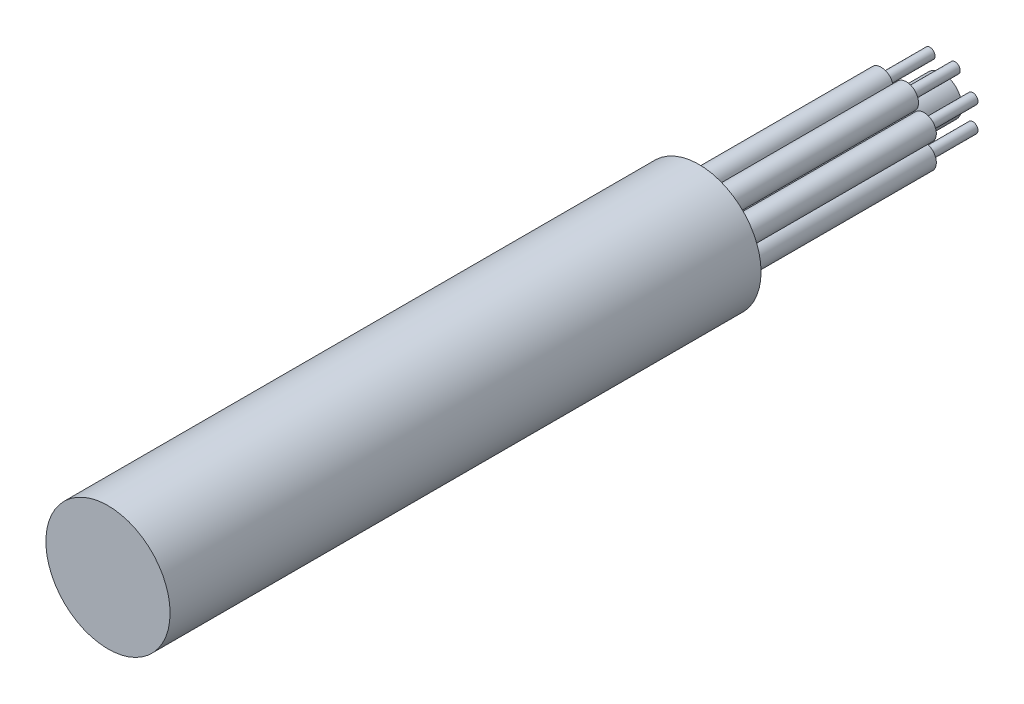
ISO-10303-21;
HEADER;
FILE_DESCRIPTION(('STEP AP214'),'2;1');
FILE_NAME('part.step','',(''),(''),'','','');
FILE_SCHEMA(('AUTOMOTIVE_DESIGN { 1 0 10303 214 1 1 1 1 }'));
ENDSEC;
DATA;
#1=APPLICATION_CONTEXT('core data for automotive mechanical design processes');
#2=APPLICATION_PROTOCOL_DEFINITION('international standard','automotive_design',2000,#1);
#3=PRODUCT_CONTEXT('',#1,'mechanical');
#4=PRODUCT('Part','Part','',(#3));
#5=PRODUCT_RELATED_PRODUCT_CATEGORY('part','',(#4));
#6=PRODUCT_DEFINITION_FORMATION('','',#4);
#7=PRODUCT_DEFINITION_CONTEXT('part definition',#1,'design');
#8=PRODUCT_DEFINITION('design','',#6,#7);
#9=PRODUCT_DEFINITION_SHAPE('','',#8);
#10=(LENGTH_UNIT() NAMED_UNIT(*) SI_UNIT(.MILLI.,.METRE.));
#11=(NAMED_UNIT(*) PLANE_ANGLE_UNIT() SI_UNIT($,.RADIAN.));
#12=(NAMED_UNIT(*) SI_UNIT($,.STERADIAN.) SOLID_ANGLE_UNIT());
#13=UNCERTAINTY_MEASURE_WITH_UNIT(LENGTH_MEASURE(1.E-05),#10,'distance_accuracy_value','');
#14=(GEOMETRIC_REPRESENTATION_CONTEXT(3) GLOBAL_UNCERTAINTY_ASSIGNED_CONTEXT((#13)) GLOBAL_UNIT_ASSIGNED_CONTEXT((#10,
#11,#12)) REPRESENTATION_CONTEXT('',''));
#15=CARTESIAN_POINT('',(0.,0.,0.));
#16=DIRECTION('',(0.,0.,1.));
#17=DIRECTION('',(1.,0.,0.));
#18=AXIS2_PLACEMENT_3D('',#15,#16,#17);
#19=CARTESIAN_POINT('',(0.,0.,-150.));
#20=DIRECTION('',(0.,0.,1.));
#21=DIRECTION('',(1.,0.,0.));
#22=AXIS2_PLACEMENT_3D('',#19,#20,#21);
#23=PLANE('',#22);
#24=CARTESIAN_POINT('',(-17.9775743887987,2.07026641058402E-08,-150.));
#25=DIRECTION('',(0.,0.,1.));
#26=DIRECTION('',(1.,0.,0.));
#27=AXIS2_PLACEMENT_3D('',#24,#25,#26);
#28=CIRCLE('',#27,2.55);
#29=CARTESIAN_POINT('',(-15.4275743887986,2.07026641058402E-08,-150.));
#30=VERTEX_POINT('',#29);
#31=EDGE_CURVE('E19',#30,#30,#28,.F.);
#32=ORIENTED_EDGE('',*,*,#31,.F.);
#33=EDGE_LOOP('',(#32));
#34=FACE_BOUND('',#33,.T.);
#35=ADVANCED_FACE('F15',(#34),#23,.T.);
#36=CARTESIAN_POINT('',(-18.2085442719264,-1.48067083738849,-184.265855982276));
#37=DIRECTION('',(0.,0.,-1.));
#38=DIRECTION('',(1.,0.,0.));
#39=AXIS2_PLACEMENT_3D('',#36,#37,#38);
#40=PLANE('',#39);
#41=CARTESIAN_POINT('',(-16.7303370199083,0.516622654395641,-184.265855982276));
#42=DIRECTION('',(0.,0.,-1.));
#43=DIRECTION('',(1.,0.,0.));
#44=AXIS2_PLACEMENT_3D('',#41,#42,#43);
#45=CIRCLE('',#44,0.2111005);
#46=CARTESIAN_POINT('',(-16.5192365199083,0.51662265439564,-184.265855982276));
#47=VERTEX_POINT('',#46);
#48=EDGE_CURVE('E10',#47,#47,#45,.F.);
#49=ORIENTED_EDGE('',*,*,#48,.F.);
#50=EDGE_LOOP('',(#49));
#51=FACE_BOUND('',#50,.T.);
#52=ADVANCED_FACE('F134',(#51),#40,.T.);
#53=CARTESIAN_POINT('',(-17.7466045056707,-1.28932912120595,-184.265855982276));
#54=DIRECTION('',(0.,0.,-1.));
#55=DIRECTION('',(1.,0.,0.));
#56=AXIS2_PLACEMENT_3D('',#53,#54,#55);
#57=PLANE('',#56);
#58=CARTESIAN_POINT('',(-19.2248117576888,-0.516622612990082,-184.265855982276));
#59=DIRECTION('',(0.,0.,-1.));
#60=DIRECTION('',(1.,0.,0.));
#61=AXIS2_PLACEMENT_3D('',#58,#59,#60);
#62=CIRCLE('',#61,0.2111005);
#63=CARTESIAN_POINT('',(-19.0137112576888,-0.516622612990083,-184.265855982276));
#64=VERTEX_POINT('',#63);
#65=EDGE_CURVE('E23',#64,#64,#62,.F.);
#66=ORIENTED_EDGE('',*,*,#65,.F.);
#67=EDGE_LOOP('',(#66));
#68=FACE_BOUND('',#67,.T.);
#69=ADVANCED_FACE('F140',(#68),#57,.T.);
#70=CARTESIAN_POINT('',(-17.7466045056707,-1.4806708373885,-184.265855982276));
#71=DIRECTION('',(0.,0.,-1.));
#72=DIRECTION('',(1.,0.,0.));
#73=AXIS2_PLACEMENT_3D('',#70,#71,#72);
#74=PLANE('',#73);
#75=CARTESIAN_POINT('',(-19.2248117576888,0.516622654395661,-184.265855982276));
#76=DIRECTION('',(0.,0.,-1.));
#77=DIRECTION('',(1.,0.,0.));
#78=AXIS2_PLACEMENT_3D('',#75,#76,#77);
#79=CIRCLE('',#78,0.2111005);
#80=CARTESIAN_POINT('',(-19.0137112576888,0.51662265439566,-184.265855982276));
#81=VERTEX_POINT('',#80);
#82=EDGE_CURVE('E28',#81,#81,#79,.F.);
#83=ORIENTED_EDGE('',*,*,#82,.F.);
#84=EDGE_LOOP('',(#83));
#85=FACE_BOUND('',#84,.T.);
#86=ADVANCED_FACE('F278',(#85),#74,.T.);
#87=CARTESIAN_POINT('',(-18.2085442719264,-1.28932912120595,-184.265855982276));
#88=DIRECTION('',(0.,0.,-1.));
#89=DIRECTION('',(1.,0.,0.));
#90=AXIS2_PLACEMENT_3D('',#87,#88,#89);
#91=PLANE('',#90);
#92=CARTESIAN_POINT('',(-16.7303370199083,-0.516622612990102,-184.265855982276));
#93=DIRECTION('',(0.,0.,-1.));
#94=DIRECTION('',(1.,0.,0.));
#95=AXIS2_PLACEMENT_3D('',#92,#93,#94);
#96=CIRCLE('',#95,0.2111005);
#97=CARTESIAN_POINT('',(-16.5192365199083,-0.516622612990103,-184.265855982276));
#98=VERTEX_POINT('',#97);
#99=EDGE_CURVE('E33',#98,#98,#96,.F.);
#100=ORIENTED_EDGE('',*,*,#99,.F.);
#101=EDGE_LOOP('',(#100));
#102=FACE_BOUND('',#101,.T.);
#103=ADVANCED_FACE('F274',(#102),#91,.T.);
#104=CARTESIAN_POINT('',(-18.0732452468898,-1.61596986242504,-184.265855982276));
#105=DIRECTION('',(0.,0.,-1.));
#106=DIRECTION('',(1.,0.,0.));
#107=AXIS2_PLACEMENT_3D('',#104,#105,#106);
#108=PLANE('',#107);
#109=CARTESIAN_POINT('',(-17.4609517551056,1.24723738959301,-184.265855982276));
#110=DIRECTION('',(0.,0.,-1.));
#111=DIRECTION('',(1.,0.,0.));
#112=AXIS2_PLACEMENT_3D('',#109,#110,#111);
#113=CIRCLE('',#112,0.2111005);
#114=CARTESIAN_POINT('',(-17.2498512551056,1.24723738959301,-184.265855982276));
#115=VERTEX_POINT('',#114);
#116=EDGE_CURVE('E36',#115,#115,#113,.F.);
#117=ORIENTED_EDGE('',*,*,#116,.F.);
#118=EDGE_LOOP('',(#117));
#119=FACE_BOUND('',#118,.T.);
#120=ADVANCED_FACE('F270',(#119),#108,.T.);
#121=CARTESIAN_POINT('',(-18.0732452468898,-1.1540300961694,-184.265855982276));
#122=DIRECTION('',(0.,0.,-1.));
#123=DIRECTION('',(1.,0.,0.));
#124=AXIS2_PLACEMENT_3D('',#121,#122,#123);
#125=PLANE('',#124);
#126=CARTESIAN_POINT('',(-17.4609517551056,-1.24723734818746,-184.265855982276));
#127=DIRECTION('',(0.,0.,-1.));
#128=DIRECTION('',(1.,0.,0.));
#129=AXIS2_PLACEMENT_3D('',#126,#127,#128);
#130=CIRCLE('',#129,0.2111005);
#131=CARTESIAN_POINT('',(-17.2498512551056,-1.24723734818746,-184.265855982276));
#132=VERTEX_POINT('',#131);
#133=EDGE_CURVE('E39',#132,#132,#130,.F.);
#134=ORIENTED_EDGE('',*,*,#133,.F.);
#135=EDGE_LOOP('',(#134));
#136=FACE_BOUND('',#135,.T.);
#137=ADVANCED_FACE('F266',(#136),#125,.T.);
#138=CARTESIAN_POINT('',(-17.8819035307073,-1.61596986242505,-184.265855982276));
#139=DIRECTION('',(0.,0.,-1.));
#140=DIRECTION('',(1.,0.,0.));
#141=AXIS2_PLACEMENT_3D('',#138,#139,#140);
#142=PLANE('',#141);
#143=CARTESIAN_POINT('',(-18.4941970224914,1.24723738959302,-184.265855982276));
#144=DIRECTION('',(0.,0.,-1.));
#145=DIRECTION('',(1.,0.,0.));
#146=AXIS2_PLACEMENT_3D('',#143,#144,#145);
#147=CIRCLE('',#146,0.2111005);
#148=CARTESIAN_POINT('',(-18.2830965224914,1.24723738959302,-184.265855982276));
#149=VERTEX_POINT('',#148);
#150=EDGE_CURVE('E42',#149,#149,#147,.F.);
#151=ORIENTED_EDGE('',*,*,#150,.F.);
#152=EDGE_LOOP('',(#151));
#153=FACE_BOUND('',#152,.T.);
#154=ADVANCED_FACE('F262',(#153),#142,.T.);
#155=CARTESIAN_POINT('',(-17.8819035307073,-1.1540300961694,-184.265855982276));
#156=DIRECTION('',(0.,0.,-1.));
#157=DIRECTION('',(1.,0.,0.));
#158=AXIS2_PLACEMENT_3D('',#155,#156,#157);
#159=PLANE('',#158);
#160=CARTESIAN_POINT('',(-18.4941970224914,-1.24723734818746,-184.265855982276));
#161=DIRECTION('',(0.,0.,-1.));
#162=DIRECTION('',(1.,0.,0.));
#163=AXIS2_PLACEMENT_3D('',#160,#161,#162);
#164=CIRCLE('',#163,0.2111005);
#165=CARTESIAN_POINT('',(-18.2830965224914,-1.24723734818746,-184.265855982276));
#166=VERTEX_POINT('',#165);
#167=EDGE_CURVE('E45',#166,#166,#164,.F.);
#168=ORIENTED_EDGE('',*,*,#167,.F.);
#169=EDGE_LOOP('',(#168));
#170=FACE_BOUND('',#169,.T.);
#171=ADVANCED_FACE('F259',(#170),#159,.T.);
#172=CARTESIAN_POINT('',(-16.7303370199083,0.516622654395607,-174.265855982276));
#173=DIRECTION('',(0.,0.,-1.));
#174=DIRECTION('',(1.,0.,0.));
#175=AXIS2_PLACEMENT_3D('',#172,#173,#174);
#176=CYLINDRICAL_SURFACE('',#175,0.2111005);
#177=ORIENTED_EDGE('',*,*,#48,.T.);
#178=EDGE_LOOP('',(#177));
#179=FACE_BOUND('',#178,.T.);
#180=CARTESIAN_POINT('',(-16.7303370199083,0.516622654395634,-182.265855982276));
#181=DIRECTION('',(0.,0.,-1.));
#182=DIRECTION('',(1.,0.,0.));
#183=AXIS2_PLACEMENT_3D('',#180,#181,#182);
#184=CIRCLE('',#183,0.2111005);
#185=CARTESIAN_POINT('',(-16.5192365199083,0.516622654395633,-182.265855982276));
#186=VERTEX_POINT('',#185);
#187=EDGE_CURVE('E48',#186,#186,#184,.F.);
#188=ORIENTED_EDGE('',*,*,#187,.F.);
#189=EDGE_LOOP('',(#188));
#190=FACE_BOUND('',#189,.T.);
#191=ADVANCED_FACE('F255',(#179,#190),#176,.T.);
#192=CARTESIAN_POINT('',(-19.2248117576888,-0.516622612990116,-174.265855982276));
#193=DIRECTION('',(0.,0.,-1.));
#194=DIRECTION('',(1.,0.,0.));
#195=AXIS2_PLACEMENT_3D('',#192,#193,#194);
#196=CYLINDRICAL_SURFACE('',#195,0.2111005);
#197=ORIENTED_EDGE('',*,*,#65,.T.);
#198=EDGE_LOOP('',(#197));
#199=FACE_BOUND('',#198,.T.);
#200=CARTESIAN_POINT('',(-19.2248117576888,-0.516622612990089,-182.265855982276));
#201=DIRECTION('',(0.,0.,-1.));
#202=DIRECTION('',(1.,0.,0.));
#203=AXIS2_PLACEMENT_3D('',#200,#201,#202);
#204=CIRCLE('',#203,0.2111005);
#205=CARTESIAN_POINT('',(-19.0137112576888,-0.51662261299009,-182.265855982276));
#206=VERTEX_POINT('',#205);
#207=EDGE_CURVE('E51',#206,#206,#204,.F.);
#208=ORIENTED_EDGE('',*,*,#207,.F.);
#209=EDGE_LOOP('',(#208));
#210=FACE_BOUND('',#209,.T.);
#211=ADVANCED_FACE('F251',(#199,#210),#196,.T.);
#212=CARTESIAN_POINT('',(-19.2248117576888,0.516622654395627,-174.265855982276));
#213=DIRECTION('',(0.,0.,-1.));
#214=DIRECTION('',(1.,0.,0.));
#215=AXIS2_PLACEMENT_3D('',#212,#213,#214);
#216=CYLINDRICAL_SURFACE('',#215,0.2111005);
#217=ORIENTED_EDGE('',*,*,#82,.T.);
#218=EDGE_LOOP('',(#217));
#219=FACE_BOUND('',#218,.T.);
#220=CARTESIAN_POINT('',(-19.2248117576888,0.516622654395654,-182.265855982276));
#221=DIRECTION('',(0.,0.,-1.));
#222=DIRECTION('',(1.,0.,0.));
#223=AXIS2_PLACEMENT_3D('',#220,#221,#222);
#224=CIRCLE('',#223,0.2111005);
#225=CARTESIAN_POINT('',(-19.0137112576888,0.516622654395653,-182.265855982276));
#226=VERTEX_POINT('',#225);
#227=EDGE_CURVE('E54',#226,#226,#224,.F.);
#228=ORIENTED_EDGE('',*,*,#227,.F.);
#229=EDGE_LOOP('',(#228));
#230=FACE_BOUND('',#229,.T.);
#231=ADVANCED_FACE('F247',(#219,#230),#216,.T.);
#232=CARTESIAN_POINT('',(-16.7303370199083,-0.516622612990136,-174.265855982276));
#233=DIRECTION('',(0.,0.,-1.));
#234=DIRECTION('',(1.,0.,0.));
#235=AXIS2_PLACEMENT_3D('',#232,#233,#234);
#236=CYLINDRICAL_SURFACE('',#235,0.2111005);
#237=ORIENTED_EDGE('',*,*,#99,.T.);
#238=EDGE_LOOP('',(#237));
#239=FACE_BOUND('',#238,.T.);
#240=CARTESIAN_POINT('',(-16.7303370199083,-0.516622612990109,-182.265855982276));
#241=DIRECTION('',(0.,0.,-1.));
#242=DIRECTION('',(1.,0.,0.));
#243=AXIS2_PLACEMENT_3D('',#240,#241,#242);
#244=CIRCLE('',#243,0.2111005);
#245=CARTESIAN_POINT('',(-16.5192365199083,-0.51662261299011,-182.265855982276));
#246=VERTEX_POINT('',#245);
#247=EDGE_CURVE('E57',#246,#246,#244,.F.);
#248=ORIENTED_EDGE('',*,*,#247,.F.);
#249=EDGE_LOOP('',(#248));
#250=FACE_BOUND('',#249,.T.);
#251=ADVANCED_FACE('F243',(#239,#250),#236,.T.);
#252=CARTESIAN_POINT('',(-17.4609517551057,1.24723738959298,-174.265855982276));
#253=DIRECTION('',(0.,0.,-1.));
#254=DIRECTION('',(1.,0.,0.));
#255=AXIS2_PLACEMENT_3D('',#252,#253,#254);
#256=CYLINDRICAL_SURFACE('',#255,0.2111005);
#257=ORIENTED_EDGE('',*,*,#116,.T.);
#258=EDGE_LOOP('',(#257));
#259=FACE_BOUND('',#258,.T.);
#260=CARTESIAN_POINT('',(-17.4609517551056,1.247237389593,-182.265855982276));
#261=DIRECTION('',(0.,0.,-1.));
#262=DIRECTION('',(1.,0.,0.));
#263=AXIS2_PLACEMENT_3D('',#260,#261,#262);
#264=CIRCLE('',#263,0.2111005);
#265=CARTESIAN_POINT('',(-17.2498512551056,1.247237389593,-182.265855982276));
#266=VERTEX_POINT('',#265);
#267=EDGE_CURVE('E60',#266,#266,#264,.F.);
#268=ORIENTED_EDGE('',*,*,#267,.F.);
#269=EDGE_LOOP('',(#268));
#270=FACE_BOUND('',#269,.T.);
#271=ADVANCED_FACE('F239',(#259,#270),#256,.T.);
#272=CARTESIAN_POINT('',(-17.4609517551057,-1.24723734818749,-174.265855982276));
#273=DIRECTION('',(0.,0.,-1.));
#274=DIRECTION('',(1.,0.,0.));
#275=AXIS2_PLACEMENT_3D('',#272,#273,#274);
#276=CYLINDRICAL_SURFACE('',#275,0.2111005);
#277=ORIENTED_EDGE('',*,*,#133,.T.);
#278=EDGE_LOOP('',(#277));
#279=FACE_BOUND('',#278,.T.);
#280=CARTESIAN_POINT('',(-17.4609517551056,-1.24723734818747,-182.265855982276));
#281=DIRECTION('',(0.,0.,-1.));
#282=DIRECTION('',(1.,0.,0.));
#283=AXIS2_PLACEMENT_3D('',#280,#281,#282);
#284=CIRCLE('',#283,0.2111005);
#285=CARTESIAN_POINT('',(-17.2498512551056,-1.24723734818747,-182.265855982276));
#286=VERTEX_POINT('',#285);
#287=EDGE_CURVE('E63',#286,#286,#284,.F.);
#288=ORIENTED_EDGE('',*,*,#287,.F.);
#289=EDGE_LOOP('',(#288));
#290=FACE_BOUND('',#289,.T.);
#291=ADVANCED_FACE('F235',(#279,#290),#276,.T.);
#292=CARTESIAN_POINT('',(-18.4941970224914,1.24723738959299,-174.265855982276));
#293=DIRECTION('',(0.,0.,-1.));
#294=DIRECTION('',(1.,0.,0.));
#295=AXIS2_PLACEMENT_3D('',#292,#293,#294);
#296=CYLINDRICAL_SURFACE('',#295,0.2111005);
#297=ORIENTED_EDGE('',*,*,#150,.T.);
#298=EDGE_LOOP('',(#297));
#299=FACE_BOUND('',#298,.T.);
#300=CARTESIAN_POINT('',(-18.4941970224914,1.24723738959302,-182.265855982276));
#301=DIRECTION('',(0.,0.,-1.));
#302=DIRECTION('',(1.,0.,0.));
#303=AXIS2_PLACEMENT_3D('',#300,#301,#302);
#304=CIRCLE('',#303,0.2111005);
#305=CARTESIAN_POINT('',(-18.2830965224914,1.24723738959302,-182.265855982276));
#306=VERTEX_POINT('',#305);
#307=EDGE_CURVE('E66',#306,#306,#304,.F.);
#308=ORIENTED_EDGE('',*,*,#307,.F.);
#309=EDGE_LOOP('',(#308));
#310=FACE_BOUND('',#309,.T.);
#311=ADVANCED_FACE('F231',(#299,#310),#296,.T.);
#312=CARTESIAN_POINT('',(-18.4941970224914,-1.24723734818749,-174.265855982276));
#313=DIRECTION('',(0.,0.,-1.));
#314=DIRECTION('',(1.,0.,0.));
#315=AXIS2_PLACEMENT_3D('',#312,#313,#314);
#316=CYLINDRICAL_SURFACE('',#315,0.2111005);
#317=ORIENTED_EDGE('',*,*,#167,.T.);
#318=EDGE_LOOP('',(#317));
#319=FACE_BOUND('',#318,.T.);
#320=CARTESIAN_POINT('',(-18.4941970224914,-1.24723734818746,-182.265855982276));
#321=DIRECTION('',(0.,0.,-1.));
#322=DIRECTION('',(1.,0.,0.));
#323=AXIS2_PLACEMENT_3D('',#320,#321,#322);
#324=CIRCLE('',#323,0.2111005);
#325=CARTESIAN_POINT('',(-18.2830965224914,-1.24723734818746,-182.265855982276));
#326=VERTEX_POINT('',#325);
#327=EDGE_CURVE('E69',#326,#326,#324,.F.);
#328=ORIENTED_EDGE('',*,*,#327,.F.);
#329=EDGE_LOOP('',(#328));
#330=FACE_BOUND('',#329,.T.);
#331=ADVANCED_FACE('F227',(#319,#330),#316,.T.);
#332=CARTESIAN_POINT('',(-18.2085442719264,-1.48067083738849,-182.265855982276));
#333=DIRECTION('',(0.,0.,-1.));
#334=DIRECTION('',(1.,0.,0.));
#335=AXIS2_PLACEMENT_3D('',#332,#333,#334);
#336=PLANE('',#335);
#337=CARTESIAN_POINT('',(-16.7303370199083,0.516622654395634,-182.265855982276));
#338=DIRECTION('',(0.,0.,-1.));
#339=DIRECTION('',(1.,0.,0.));
#340=AXIS2_PLACEMENT_3D('',#337,#338,#339);
#341=CIRCLE('',#340,0.5);
#342=CARTESIAN_POINT('',(-16.2303370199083,0.516622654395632,-182.265855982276));
#343=VERTEX_POINT('',#342);
#344=EDGE_CURVE('E72',#343,#343,#341,.F.);
#345=ORIENTED_EDGE('',*,*,#344,.F.);
#346=EDGE_LOOP('',(#345));
#347=FACE_BOUND('',#346,.T.);
#348=ORIENTED_EDGE('',*,*,#187,.T.);
#349=EDGE_LOOP('',(#348));
#350=FACE_BOUND('',#349,.T.);
#351=ADVANCED_FACE('F223',(#347,#350),#336,.T.);
#352=CARTESIAN_POINT('',(-17.7466045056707,-1.28932912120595,-182.265855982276));
#353=DIRECTION('',(0.,0.,-1.));
#354=DIRECTION('',(1.,0.,0.));
#355=AXIS2_PLACEMENT_3D('',#352,#353,#354);
#356=PLANE('',#355);
#357=CARTESIAN_POINT('',(-19.2248117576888,-0.516622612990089,-182.265855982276));
#358=DIRECTION('',(0.,0.,-1.));
#359=DIRECTION('',(1.,0.,0.));
#360=AXIS2_PLACEMENT_3D('',#357,#358,#359);
#361=CIRCLE('',#360,0.5);
#362=CARTESIAN_POINT('',(-18.7248117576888,-0.516622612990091,-182.265855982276));
#363=VERTEX_POINT('',#362);
#364=EDGE_CURVE('E75',#363,#363,#361,.F.);
#365=ORIENTED_EDGE('',*,*,#364,.F.);
#366=EDGE_LOOP('',(#365));
#367=FACE_BOUND('',#366,.T.);
#368=ORIENTED_EDGE('',*,*,#207,.T.);
#369=EDGE_LOOP('',(#368));
#370=FACE_BOUND('',#369,.T.);
#371=ADVANCED_FACE('F219',(#367,#370),#356,.T.);
#372=CARTESIAN_POINT('',(-17.7466045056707,-1.4806708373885,-182.265855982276));
#373=DIRECTION('',(0.,0.,-1.));
#374=DIRECTION('',(1.,0.,0.));
#375=AXIS2_PLACEMENT_3D('',#372,#373,#374);
#376=PLANE('',#375);
#377=CARTESIAN_POINT('',(-19.2248117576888,0.516622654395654,-182.265855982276));
#378=DIRECTION('',(0.,0.,-1.));
#379=DIRECTION('',(1.,0.,0.));
#380=AXIS2_PLACEMENT_3D('',#377,#378,#379);
#381=CIRCLE('',#380,0.5);
#382=CARTESIAN_POINT('',(-18.7248117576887,0.516622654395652,-182.265855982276));
#383=VERTEX_POINT('',#382);
#384=EDGE_CURVE('E78',#383,#383,#381,.F.);
#385=ORIENTED_EDGE('',*,*,#384,.F.);
#386=EDGE_LOOP('',(#385));
#387=FACE_BOUND('',#386,.T.);
#388=ORIENTED_EDGE('',*,*,#227,.T.);
#389=EDGE_LOOP('',(#388));
#390=FACE_BOUND('',#389,.T.);
#391=ADVANCED_FACE('F215',(#387,#390),#376,.T.);
#392=CARTESIAN_POINT('',(-18.2085442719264,-1.28932912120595,-182.265855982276));
#393=DIRECTION('',(0.,0.,-1.));
#394=DIRECTION('',(1.,0.,0.));
#395=AXIS2_PLACEMENT_3D('',#392,#393,#394);
#396=PLANE('',#395);
#397=CARTESIAN_POINT('',(-16.7303370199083,-0.516622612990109,-182.265855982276));
#398=DIRECTION('',(0.,0.,-1.));
#399=DIRECTION('',(1.,0.,0.));
#400=AXIS2_PLACEMENT_3D('',#397,#398,#399);
#401=CIRCLE('',#400,0.5);
#402=CARTESIAN_POINT('',(-16.2303370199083,-0.516622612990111,-182.265855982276));
#403=VERTEX_POINT('',#402);
#404=EDGE_CURVE('E81',#403,#403,#401,.F.);
#405=ORIENTED_EDGE('',*,*,#404,.F.);
#406=EDGE_LOOP('',(#405));
#407=FACE_BOUND('',#406,.T.);
#408=ORIENTED_EDGE('',*,*,#247,.T.);
#409=EDGE_LOOP('',(#408));
#410=FACE_BOUND('',#409,.T.);
#411=ADVANCED_FACE('F211',(#407,#410),#396,.T.);
#412=CARTESIAN_POINT('',(-18.0732452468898,-1.61596986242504,-182.265855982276));
#413=DIRECTION('',(0.,0.,-1.));
#414=DIRECTION('',(1.,0.,0.));
#415=AXIS2_PLACEMENT_3D('',#412,#413,#414);
#416=PLANE('',#415);
#417=CARTESIAN_POINT('',(-17.4609517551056,1.247237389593,-182.265855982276));
#418=DIRECTION('',(0.,0.,-1.));
#419=DIRECTION('',(1.,0.,0.));
#420=AXIS2_PLACEMENT_3D('',#417,#418,#419);
#421=CIRCLE('',#420,0.5);
#422=CARTESIAN_POINT('',(-16.9609517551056,1.247237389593,-182.265855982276));
#423=VERTEX_POINT('',#422);
#424=EDGE_CURVE('E84',#423,#423,#421,.F.);
#425=ORIENTED_EDGE('',*,*,#424,.F.);
#426=EDGE_LOOP('',(#425));
#427=FACE_BOUND('',#426,.T.);
#428=ORIENTED_EDGE('',*,*,#267,.T.);
#429=EDGE_LOOP('',(#428));
#430=FACE_BOUND('',#429,.T.);
#431=ADVANCED_FACE('F207',(#427,#430),#416,.T.);
#432=CARTESIAN_POINT('',(-18.0732452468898,-1.1540300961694,-182.265855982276));
#433=DIRECTION('',(0.,0.,-1.));
#434=DIRECTION('',(1.,0.,0.));
#435=AXIS2_PLACEMENT_3D('',#432,#433,#434);
#436=PLANE('',#435);
#437=CARTESIAN_POINT('',(-17.4609517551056,-1.24723734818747,-182.265855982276));
#438=DIRECTION('',(0.,0.,-1.));
#439=DIRECTION('',(1.,0.,0.));
#440=AXIS2_PLACEMENT_3D('',#437,#438,#439);
#441=CIRCLE('',#440,0.5);
#442=CARTESIAN_POINT('',(-16.9609517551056,-1.24723734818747,-182.265855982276));
#443=VERTEX_POINT('',#442);
#444=EDGE_CURVE('E87',#443,#443,#441,.F.);
#445=ORIENTED_EDGE('',*,*,#444,.F.);
#446=EDGE_LOOP('',(#445));
#447=FACE_BOUND('',#446,.T.);
#448=ORIENTED_EDGE('',*,*,#287,.T.);
#449=EDGE_LOOP('',(#448));
#450=FACE_BOUND('',#449,.T.);
#451=ADVANCED_FACE('F203',(#447,#450),#436,.T.);
#452=CARTESIAN_POINT('',(-17.8819035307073,-1.61596986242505,-182.265855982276));
#453=DIRECTION('',(0.,0.,-1.));
#454=DIRECTION('',(1.,0.,0.));
#455=AXIS2_PLACEMENT_3D('',#452,#453,#454);
#456=PLANE('',#455);
#457=CARTESIAN_POINT('',(-18.4941970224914,1.24723738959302,-182.265855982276));
#458=DIRECTION('',(0.,0.,-1.));
#459=DIRECTION('',(1.,0.,0.));
#460=AXIS2_PLACEMENT_3D('',#457,#458,#459);
#461=CIRCLE('',#460,0.5);
#462=CARTESIAN_POINT('',(-17.9941970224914,1.24723738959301,-182.265855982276));
#463=VERTEX_POINT('',#462);
#464=EDGE_CURVE('E90',#463,#463,#461,.F.);
#465=ORIENTED_EDGE('',*,*,#464,.F.);
#466=EDGE_LOOP('',(#465));
#467=FACE_BOUND('',#466,.T.);
#468=ORIENTED_EDGE('',*,*,#307,.T.);
#469=EDGE_LOOP('',(#468));
#470=FACE_BOUND('',#469,.T.);
#471=ADVANCED_FACE('F199',(#467,#470),#456,.T.);
#472=CARTESIAN_POINT('',(-17.8819035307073,-1.1540300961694,-182.265855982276));
#473=DIRECTION('',(0.,0.,-1.));
#474=DIRECTION('',(1.,0.,0.));
#475=AXIS2_PLACEMENT_3D('',#472,#473,#474);
#476=PLANE('',#475);
#477=CARTESIAN_POINT('',(-18.4941970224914,-1.24723734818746,-182.265855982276));
#478=DIRECTION('',(0.,0.,-1.));
#479=DIRECTION('',(1.,0.,0.));
#480=AXIS2_PLACEMENT_3D('',#477,#478,#479);
#481=CIRCLE('',#480,0.5);
#482=CARTESIAN_POINT('',(-17.9941970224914,-1.24723734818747,-182.265855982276));
#483=VERTEX_POINT('',#482);
#484=EDGE_CURVE('E93',#483,#483,#481,.F.);
#485=ORIENTED_EDGE('',*,*,#484,.F.);
#486=EDGE_LOOP('',(#485));
#487=FACE_BOUND('',#486,.T.);
#488=ORIENTED_EDGE('',*,*,#327,.T.);
#489=EDGE_LOOP('',(#488));
#490=FACE_BOUND('',#489,.T.);
#491=ADVANCED_FACE('F195',(#487,#490),#476,.T.);
#492=CARTESIAN_POINT('',(-17.9775743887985,-1.38499997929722,-184.265855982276));
#493=DIRECTION('',(0.,0.,-1.));
#494=DIRECTION('',(1.,0.,0.));
#495=AXIS2_PLACEMENT_3D('',#492,#493,#494);
#496=PLANE('',#495);
#497=CARTESIAN_POINT('',(-17.9775743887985,2.07027796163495E-08,-184.265855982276));
#498=DIRECTION('',(0.,0.,-1.));
#499=DIRECTION('',(1.,0.,0.));
#500=AXIS2_PLACEMENT_3D('',#497,#498,#499);
#501=CIRCLE('',#500,0.8);
#502=CARTESIAN_POINT('',(-17.1775743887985,2.07027768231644E-08,-184.265855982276));
#503=VERTEX_POINT('',#502);
#504=EDGE_CURVE('E96',#503,#503,#501,.F.);
#505=ORIENTED_EDGE('',*,*,#504,.F.);
#506=EDGE_LOOP('',(#505));
#507=FACE_BOUND('',#506,.T.);
#508=ADVANCED_FACE('F191',(#507),#496,.T.);
#509=CARTESIAN_POINT('',(-16.7303370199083,0.516622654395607,-174.265855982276));
#510=DIRECTION('',(0.,0.,-1.));
#511=DIRECTION('',(1.,0.,0.));
#512=AXIS2_PLACEMENT_3D('',#509,#510,#511);
#513=CYLINDRICAL_SURFACE('',#512,0.5);
#514=ORIENTED_EDGE('',*,*,#344,.T.);
#515=EDGE_LOOP('',(#514));
#516=FACE_BOUND('',#515,.T.);
#517=CARTESIAN_POINT('',(-16.7303370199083,0.516622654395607,-174.265855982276));
#518=DIRECTION('',(0.,0.,-1.));
#519=DIRECTION('',(1.,0.,0.));
#520=AXIS2_PLACEMENT_3D('',#517,#518,#519);
#521=CIRCLE('',#520,0.5);
#522=CARTESIAN_POINT('',(-16.2303370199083,0.516622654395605,-174.265855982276));
#523=VERTEX_POINT('',#522);
#524=EDGE_CURVE('E99',#523,#523,#521,.F.);
#525=ORIENTED_EDGE('',*,*,#524,.F.);
#526=EDGE_LOOP('',(#525));
#527=FACE_BOUND('',#526,.T.);
#528=ADVANCED_FACE('F187',(#516,#527),#513,.T.);
#529=CARTESIAN_POINT('',(-19.2248117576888,-0.516622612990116,-174.265855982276));
#530=DIRECTION('',(0.,0.,-1.));
#531=DIRECTION('',(1.,0.,0.));
#532=AXIS2_PLACEMENT_3D('',#529,#530,#531);
#533=CYLINDRICAL_SURFACE('',#532,0.5);
#534=ORIENTED_EDGE('',*,*,#364,.T.);
#535=EDGE_LOOP('',(#534));
#536=FACE_BOUND('',#535,.T.);
#537=CARTESIAN_POINT('',(-19.2248117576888,-0.516622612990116,-174.265855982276));
#538=DIRECTION('',(0.,0.,-1.));
#539=DIRECTION('',(1.,0.,0.));
#540=AXIS2_PLACEMENT_3D('',#537,#538,#539);
#541=CIRCLE('',#540,0.5);
#542=CARTESIAN_POINT('',(-18.7248117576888,-0.516622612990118,-174.265855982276));
#543=VERTEX_POINT('',#542);
#544=EDGE_CURVE('E102',#543,#543,#541,.F.);
#545=ORIENTED_EDGE('',*,*,#544,.F.);
#546=EDGE_LOOP('',(#545));
#547=FACE_BOUND('',#546,.T.);
#548=ADVANCED_FACE('F183',(#536,#547),#533,.T.);
#549=CARTESIAN_POINT('',(-19.2248117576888,0.516622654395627,-174.265855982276));
#550=DIRECTION('',(0.,0.,-1.));
#551=DIRECTION('',(1.,0.,0.));
#552=AXIS2_PLACEMENT_3D('',#549,#550,#551);
#553=CYLINDRICAL_SURFACE('',#552,0.5);
#554=ORIENTED_EDGE('',*,*,#384,.T.);
#555=EDGE_LOOP('',(#554));
#556=FACE_BOUND('',#555,.T.);
#557=CARTESIAN_POINT('',(-19.2248117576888,0.516622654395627,-174.265855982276));
#558=DIRECTION('',(0.,0.,-1.));
#559=DIRECTION('',(1.,0.,0.));
#560=AXIS2_PLACEMENT_3D('',#557,#558,#559);
#561=CIRCLE('',#560,0.5);
#562=CARTESIAN_POINT('',(-18.7248117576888,0.516622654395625,-174.265855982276));
#563=VERTEX_POINT('',#562);
#564=EDGE_CURVE('E105',#563,#563,#561,.F.);
#565=ORIENTED_EDGE('',*,*,#564,.F.);
#566=EDGE_LOOP('',(#565));
#567=FACE_BOUND('',#566,.T.);
#568=ADVANCED_FACE('F179',(#556,#567),#553,.T.);
#569=CARTESIAN_POINT('',(-16.7303370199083,-0.516622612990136,-174.265855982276));
#570=DIRECTION('',(0.,0.,-1.));
#571=DIRECTION('',(1.,0.,0.));
#572=AXIS2_PLACEMENT_3D('',#569,#570,#571);
#573=CYLINDRICAL_SURFACE('',#572,0.5);
#574=ORIENTED_EDGE('',*,*,#404,.T.);
#575=EDGE_LOOP('',(#574));
#576=FACE_BOUND('',#575,.T.);
#577=CARTESIAN_POINT('',(-16.7303370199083,-0.516622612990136,-174.265855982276));
#578=DIRECTION('',(0.,0.,-1.));
#579=DIRECTION('',(1.,0.,0.));
#580=AXIS2_PLACEMENT_3D('',#577,#578,#579);
#581=CIRCLE('',#580,0.5);
#582=CARTESIAN_POINT('',(-16.2303370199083,-0.516622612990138,-174.265855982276));
#583=VERTEX_POINT('',#582);
#584=EDGE_CURVE('E108',#583,#583,#581,.F.);
#585=ORIENTED_EDGE('',*,*,#584,.F.);
#586=EDGE_LOOP('',(#585));
#587=FACE_BOUND('',#586,.T.);
#588=ADVANCED_FACE('F175',(#576,#587),#573,.T.);
#589=CARTESIAN_POINT('',(-17.4609517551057,1.24723738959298,-174.265855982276));
#590=DIRECTION('',(0.,0.,-1.));
#591=DIRECTION('',(1.,0.,0.));
#592=AXIS2_PLACEMENT_3D('',#589,#590,#591);
#593=CYLINDRICAL_SURFACE('',#592,0.5);
#594=ORIENTED_EDGE('',*,*,#424,.T.);
#595=EDGE_LOOP('',(#594));
#596=FACE_BOUND('',#595,.T.);
#597=CARTESIAN_POINT('',(-17.4609517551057,1.24723738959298,-174.265855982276));
#598=DIRECTION('',(0.,0.,-1.));
#599=DIRECTION('',(1.,0.,0.));
#600=AXIS2_PLACEMENT_3D('',#597,#598,#599);
#601=CIRCLE('',#600,0.5);
#602=CARTESIAN_POINT('',(-16.9609517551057,1.24723738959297,-174.265855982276));
#603=VERTEX_POINT('',#602);
#604=EDGE_CURVE('E111',#603,#603,#601,.F.);
#605=ORIENTED_EDGE('',*,*,#604,.F.);
#606=EDGE_LOOP('',(#605));
#607=FACE_BOUND('',#606,.T.);
#608=ADVANCED_FACE('F171',(#596,#607),#593,.T.);
#609=CARTESIAN_POINT('',(-17.4609517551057,-1.24723734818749,-174.265855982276));
#610=DIRECTION('',(0.,0.,-1.));
#611=DIRECTION('',(1.,0.,0.));
#612=AXIS2_PLACEMENT_3D('',#609,#610,#611);
#613=CYLINDRICAL_SURFACE('',#612,0.5);
#614=ORIENTED_EDGE('',*,*,#444,.T.);
#615=EDGE_LOOP('',(#614));
#616=FACE_BOUND('',#615,.T.);
#617=CARTESIAN_POINT('',(-17.4609517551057,-1.24723734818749,-174.265855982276));
#618=DIRECTION('',(0.,0.,-1.));
#619=DIRECTION('',(1.,0.,0.));
#620=AXIS2_PLACEMENT_3D('',#617,#618,#619);
#621=CIRCLE('',#620,0.5);
#622=CARTESIAN_POINT('',(-16.9609517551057,-1.2472373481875,-174.265855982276));
#623=VERTEX_POINT('',#622);
#624=EDGE_CURVE('E114',#623,#623,#621,.F.);
#625=ORIENTED_EDGE('',*,*,#624,.F.);
#626=EDGE_LOOP('',(#625));
#627=FACE_BOUND('',#626,.T.);
#628=ADVANCED_FACE('F167',(#616,#627),#613,.T.);
#629=CARTESIAN_POINT('',(-18.4941970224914,1.24723738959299,-174.265855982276));
#630=DIRECTION('',(0.,0.,-1.));
#631=DIRECTION('',(1.,0.,0.));
#632=AXIS2_PLACEMENT_3D('',#629,#630,#631);
#633=CYLINDRICAL_SURFACE('',#632,0.5);
#634=ORIENTED_EDGE('',*,*,#464,.T.);
#635=EDGE_LOOP('',(#634));
#636=FACE_BOUND('',#635,.T.);
#637=CARTESIAN_POINT('',(-18.4941970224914,1.24723738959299,-174.265855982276));
#638=DIRECTION('',(0.,0.,-1.));
#639=DIRECTION('',(1.,0.,0.));
#640=AXIS2_PLACEMENT_3D('',#637,#638,#639);
#641=CIRCLE('',#640,0.5);
#642=CARTESIAN_POINT('',(-17.9941970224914,1.24723738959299,-174.265855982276));
#643=VERTEX_POINT('',#642);
#644=EDGE_CURVE('E117',#643,#643,#641,.F.);
#645=ORIENTED_EDGE('',*,*,#644,.F.);
#646=EDGE_LOOP('',(#645));
#647=FACE_BOUND('',#646,.T.);
#648=ADVANCED_FACE('F163',(#636,#647),#633,.T.);
#649=CARTESIAN_POINT('',(-18.4941970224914,-1.24723734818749,-174.265855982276));
#650=DIRECTION('',(0.,0.,-1.));
#651=DIRECTION('',(1.,0.,0.));
#652=AXIS2_PLACEMENT_3D('',#649,#650,#651);
#653=CYLINDRICAL_SURFACE('',#652,0.5);
#654=ORIENTED_EDGE('',*,*,#484,.T.);
#655=EDGE_LOOP('',(#654));
#656=FACE_BOUND('',#655,.T.);
#657=CARTESIAN_POINT('',(-18.4941970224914,-1.24723734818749,-174.265855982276));
#658=DIRECTION('',(0.,0.,-1.));
#659=DIRECTION('',(1.,0.,0.));
#660=AXIS2_PLACEMENT_3D('',#657,#658,#659);
#661=CIRCLE('',#660,0.5);
#662=CARTESIAN_POINT('',(-17.9941970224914,-1.24723734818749,-174.265855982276));
#663=VERTEX_POINT('',#662);
#664=EDGE_CURVE('E120',#663,#663,#661,.F.);
#665=ORIENTED_EDGE('',*,*,#664,.F.);
#666=EDGE_LOOP('',(#665));
#667=FACE_BOUND('',#666,.T.);
#668=ADVANCED_FACE('F156',(#656,#667),#653,.T.);
#669=CARTESIAN_POINT('',(-17.9775743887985,2.07027459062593E-08,-174.265855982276));
#670=DIRECTION('',(0.,0.,-1.));
#671=DIRECTION('',(1.,0.,0.));
#672=AXIS2_PLACEMENT_3D('',#669,#670,#671);
#673=CYLINDRICAL_SURFACE('',#672,0.8);
#674=ORIENTED_EDGE('',*,*,#504,.T.);
#675=EDGE_LOOP('',(#674));
#676=FACE_BOUND('',#675,.T.);
#677=CARTESIAN_POINT('',(-17.9775743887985,2.07027459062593E-08,-174.265855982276));
#678=DIRECTION('',(0.,0.,-1.));
#679=DIRECTION('',(1.,0.,0.));
#680=AXIS2_PLACEMENT_3D('',#677,#678,#679);
#681=CIRCLE('',#680,0.8);
#682=CARTESIAN_POINT('',(-17.1775743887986,2.07027431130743E-08,-174.265855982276));
#683=VERTEX_POINT('',#682);
#684=EDGE_CURVE('E123',#683,#683,#681,.F.);
#685=ORIENTED_EDGE('',*,*,#684,.F.);
#686=EDGE_LOOP('',(#685));
#687=FACE_BOUND('',#686,.T.);
#688=ADVANCED_FACE('F150',(#676,#687),#673,.T.);
#689=CARTESIAN_POINT('',(-17.9775743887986,-1.74999997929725,-174.265855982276));
#690=DIRECTION('',(0.,0.,-1.));
#691=DIRECTION('',(1.,0.,0.));
#692=AXIS2_PLACEMENT_3D('',#689,#690,#691);
#693=PLANE('',#692);
#694=ORIENTED_EDGE('',*,*,#684,.T.);
#695=EDGE_LOOP('',(#694));
#696=FACE_BOUND('',#695,.T.);
#697=ORIENTED_EDGE('',*,*,#664,.T.);
#698=EDGE_LOOP('',(#697));
#699=FACE_BOUND('',#698,.T.);
#700=ORIENTED_EDGE('',*,*,#644,.T.);
#701=EDGE_LOOP('',(#700));
#702=FACE_BOUND('',#701,.T.);
#703=ORIENTED_EDGE('',*,*,#624,.T.);
#704=EDGE_LOOP('',(#703));
#705=FACE_BOUND('',#704,.T.);
#706=ORIENTED_EDGE('',*,*,#604,.T.);
#707=EDGE_LOOP('',(#706));
#708=FACE_BOUND('',#707,.T.);
#709=ORIENTED_EDGE('',*,*,#584,.T.);
#710=EDGE_LOOP('',(#709));
#711=FACE_BOUND('',#710,.T.);
#712=ORIENTED_EDGE('',*,*,#564,.T.);
#713=EDGE_LOOP('',(#712));
#714=FACE_BOUND('',#713,.T.);
#715=ORIENTED_EDGE('',*,*,#544,.T.);
#716=EDGE_LOOP('',(#715));
#717=FACE_BOUND('',#716,.T.);
#718=ORIENTED_EDGE('',*,*,#524,.T.);
#719=EDGE_LOOP('',(#718));
#720=FACE_BOUND('',#719,.T.);
#721=CARTESIAN_POINT('',(-17.9775743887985,2.07027459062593E-08,-174.265855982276));
#722=DIRECTION('',(0.,0.,-1.));
#723=DIRECTION('',(1.,0.,0.));
#724=AXIS2_PLACEMENT_3D('',#721,#722,#723);
#725=CIRCLE('',#724,2.55);
#726=CARTESIAN_POINT('',(-15.4275743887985,2.07027370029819E-08,-174.265855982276));
#727=VERTEX_POINT('',#726);
#728=EDGE_CURVE('E125',#727,#727,#725,.F.);
#729=ORIENTED_EDGE('',*,*,#728,.F.);
#730=EDGE_LOOP('',(#729));
#731=FACE_BOUND('',#730,.T.);
#732=ADVANCED_FACE('F145',(#696,#699,#702,#705,#708,#711,#714,#717,#720,#731),#693,.T.);
#733=CARTESIAN_POINT('',(-17.9775743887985,2.07027459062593E-08,-174.265855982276));
#734=DIRECTION('',(0.,0.,-1.));
#735=DIRECTION('',(1.,0.,0.));
#736=AXIS2_PLACEMENT_3D('',#733,#734,#735);
#737=CYLINDRICAL_SURFACE('',#736,2.55);
#738=ORIENTED_EDGE('',*,*,#728,.T.);
#739=EDGE_LOOP('',(#738));
#740=FACE_BOUND('',#739,.T.);
#741=ORIENTED_EDGE('',*,*,#31,.T.);
#742=EDGE_LOOP('',(#741));
#743=FACE_BOUND('',#742,.T.);
#744=ADVANCED_FACE('F17',(#740,#743),#737,.T.);
#745=CLOSED_SHELL('',(#35,#52,#69,#86,#103,#120,#137,#154,#171,#191,#211,#231,#251,#271,#291,
#311,#331,#351,#371,#391,#411,#431,#451,#471,#491,#508,#528,#548,#568,#588,#608,#628,#648,#668,
#688,#732,#744));
#746=MANIFOLD_SOLID_BREP('B1',#745);
#747=ADVANCED_BREP_SHAPE_REPRESENTATION('',(#18,#746),#14);
#748=SHAPE_DEFINITION_REPRESENTATION(#9,#747);
ENDSEC;
END-ISO-10303-21;
